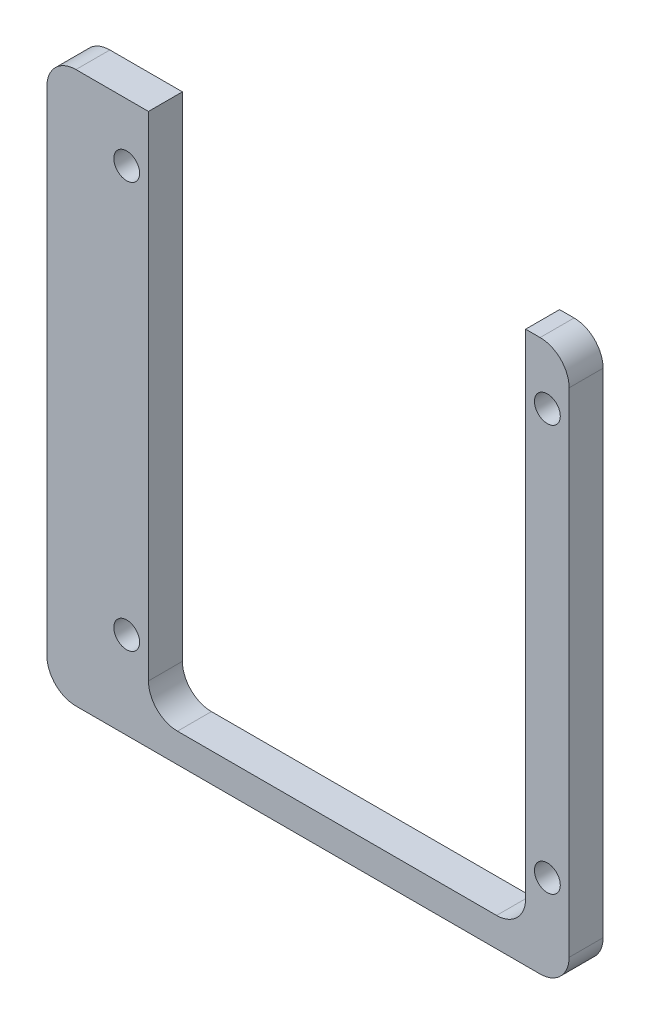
from build123d import *

# Parameters (mm, degrees)
SKETCH1_W             = 45.72
SKETCH1_H             = 48.26
BOSS_EXTRUDE1_DEPTH   = 2.9718
SKETCH2_W             = 33.02
SKETCH2_H             = 45.72
CUT_EXTRUDE1_DEPTH    = 34.371666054
F_2_CLEARANCE_HOLE1_D = 2.2606
FILLET1_R             = 2.54


with BuildPart() as part:
    # Sketch1 → Boss-Extrude1 (new body)
    with BuildSketch(Plane.XY):
        Rectangle(SKETCH1_W, SKETCH1_H)
    extrude(amount=BOSS_EXTRUDE1_DEPTH)

    # Sketch2 → Cut-Extrude1 (cut, through all)
    with BuildSketch(Plane.XY.offset(2.9718)):
        with Locations((2.54, 1.27)):
            Rectangle(SKETCH2_W, SKETCH2_H)
    extrude(amount=-CUT_EXTRUDE1_DEPTH, mode=Mode.SUBTRACT)

    # 2 Clearance Hole1 (through all)
    with Locations(Plane.XY.offset(2.9718)):
        with Locations((20.955, -16.51), (-15.875, 19.05), (-15.875, -16.51), (20.955, 19.05)):
            Hole(F_2_CLEARANCE_HOLE1_D / 2)

    # Fillet1
    fillet1_edges = [part.edges().sort_by_distance(p)[0] for p in [
        (19.05, -21.59, 1.4859),
        (-13.97, -21.59, 1.4859),
        (22.86, -24.13, 1.4859),
        (-22.86, -24.13, 1.4859),
        (-22.86, 24.13, 1.4859),
        (22.86, 24.13, 1.4859),
    ]]
    fillet(fillet1_edges, radius=FILLET1_R)


solid = part.part
